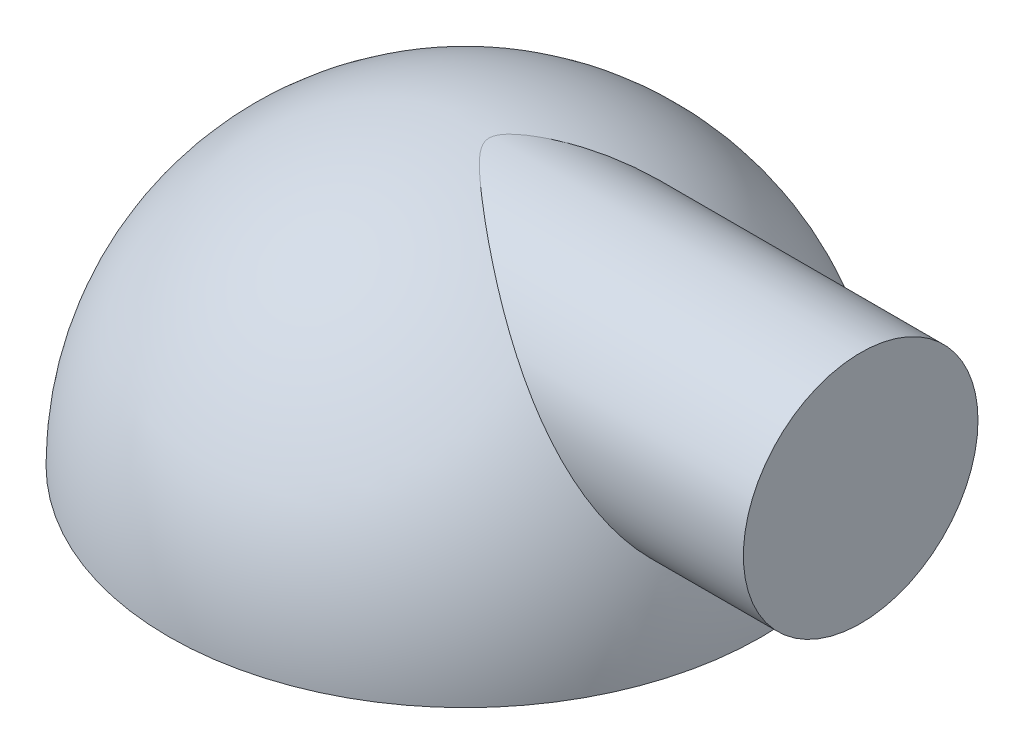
ISO-10303-21;
HEADER;
FILE_DESCRIPTION(('STEP AP214'),'2;1');
FILE_NAME('part.step','',(''),(''),'','','');
FILE_SCHEMA(('AUTOMOTIVE_DESIGN { 1 0 10303 214 1 1 1 1 }'));
ENDSEC;
DATA;
#1=APPLICATION_CONTEXT('core data for automotive mechanical design processes');
#2=APPLICATION_PROTOCOL_DEFINITION('international standard','automotive_design',2000,#1);
#3=PRODUCT_CONTEXT('',#1,'mechanical');
#4=PRODUCT('Part','Part','',(#3));
#5=PRODUCT_RELATED_PRODUCT_CATEGORY('part','',(#4));
#6=PRODUCT_DEFINITION_FORMATION('','',#4);
#7=PRODUCT_DEFINITION_CONTEXT('part definition',#1,'design');
#8=PRODUCT_DEFINITION('design','',#6,#7);
#9=PRODUCT_DEFINITION_SHAPE('','',#8);
#10=(LENGTH_UNIT() NAMED_UNIT(*) SI_UNIT(.MILLI.,.METRE.));
#11=(NAMED_UNIT(*) PLANE_ANGLE_UNIT() SI_UNIT($,.RADIAN.));
#12=(NAMED_UNIT(*) SI_UNIT($,.STERADIAN.) SOLID_ANGLE_UNIT());
#13=UNCERTAINTY_MEASURE_WITH_UNIT(LENGTH_MEASURE(1.E-05),#10,'distance_accuracy_value','');
#14=(GEOMETRIC_REPRESENTATION_CONTEXT(3) GLOBAL_UNCERTAINTY_ASSIGNED_CONTEXT((#13)) GLOBAL_UNIT_ASSIGNED_CONTEXT((#10,
#11,#12)) REPRESENTATION_CONTEXT('',''));
#15=CARTESIAN_POINT('',(0.,0.,0.));
#16=DIRECTION('',(0.,0.,1.));
#17=DIRECTION('',(1.,0.,0.));
#18=AXIS2_PLACEMENT_3D('',#15,#16,#17);
#19=CARTESIAN_POINT('',(0.,0.,0.));
#20=DIRECTION('',(0.,-1.,0.));
#21=DIRECTION('',(-1.,0.,0.));
#22=AXIS2_PLACEMENT_3D('',#19,#20,#21);
#23=SPHERICAL_SURFACE('',#22,30.);
#24=CARTESIAN_POINT('',(0.,0.,0.));
#25=DIRECTION('',(0.,-1.,0.));
#26=DIRECTION('',(1.,0.,0.));
#27=AXIS2_PLACEMENT_3D('',#24,#25,#26);
#28=CIRCLE('',#27,30.);
#29=CARTESIAN_POINT('',(30.,0.,0.));
#30=VERTEX_POINT('',#29);
#31=EDGE_CURVE('E39',#30,#30,#28,.T.);
#32=ORIENTED_EDGE('',*,*,#31,.F.);
#33=EDGE_LOOP('',(#32));
#34=FACE_BOUND('',#33,.T.);
#35=CARTESIAN_POINT('',(5.06357283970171,29.3528779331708,-3.5733439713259));
#36=CARTESIAN_POINT('',(4.82687446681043,29.4193358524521,-3.3628449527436));
#37=CARTESIAN_POINT('',(4.59214197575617,29.4805733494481,-3.14847148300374));
#38=CARTESIAN_POINT('',(4.12789198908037,29.5928167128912,-2.70777299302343));
#39=CARTESIAN_POINT('',(3.89842781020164,29.6437411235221,-2.48136939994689));
#40=CARTESIAN_POINT('',(3.56384481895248,29.711960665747,-2.12741076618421));
#41=CARTESIAN_POINT('',(3.4530889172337,29.733475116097,-2.00602128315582));
#42=CARTESIAN_POINT('',(3.23752401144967,29.773459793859,-1.75700892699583));
#43=CARTESIAN_POINT('',(3.13272863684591,29.791923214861,-1.62937291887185));
#44=CARTESIAN_POINT('',(2.93465736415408,29.8252340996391,-1.36752284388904));
#45=CARTESIAN_POINT('',(2.84125064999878,29.8401250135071,-1.23341448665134));
#46=CARTESIAN_POINT('',(2.6722454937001,29.8659536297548,-0.954172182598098));
#47=CARTESIAN_POINT('',(2.59655849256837,29.8769111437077,-0.8090980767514));
#48=CARTESIAN_POINT('',(2.5158285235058,29.8882705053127,-0.604307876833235));
#49=CARTESIAN_POINT('',(2.49680993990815,29.890908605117,-0.550273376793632));
#50=CARTESIAN_POINT('',(2.46351267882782,29.8954870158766,-0.44073530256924));
#51=CARTESIAN_POINT('',(2.44923433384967,29.8974272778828,-0.385231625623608));
#52=CARTESIAN_POINT('',(2.41489389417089,29.9020718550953,-0.217525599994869));
#53=CARTESIAN_POINT('',(2.40302373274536,29.9036413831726,-0.103410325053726));
#54=CARTESIAN_POINT('',(2.40453820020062,29.9034391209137,0.125094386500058));
#55=CARTESIAN_POINT('',(2.41803508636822,29.9016524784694,0.23948279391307));
#56=CARTESIAN_POINT('',(2.46698578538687,29.8950203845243,0.463714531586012));
#57=CARTESIAN_POINT('',(2.5025685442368,29.8901569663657,0.573527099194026));
#58=CARTESIAN_POINT('',(2.61086627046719,29.87486214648,0.840199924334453));
#59=CARTESIAN_POINT('',(2.69325720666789,29.8628599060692,0.992881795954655));
#60=CARTESIAN_POINT('',(2.83052211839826,29.8416718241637,1.21258498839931));
#61=CARTESIAN_POINT('',(2.87865706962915,29.8340615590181,1.28438835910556));
#62=CARTESIAN_POINT('',(2.97843446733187,29.8178580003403,1.42540347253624));
#63=CARTESIAN_POINT('',(3.03007559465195,29.8092650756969,1.49461617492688));
#64=CARTESIAN_POINT('',(3.19226653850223,29.781536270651,1.70341319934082));
#65=CARTESIAN_POINT('',(3.30702155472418,29.7609123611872,1.83950100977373));
#66=CARTESIAN_POINT('',(3.54299729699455,29.7161009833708,2.10538496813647));
#67=CARTESIAN_POINT('',(3.66422267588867,29.6919109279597,2.23517645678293));
#68=CARTESIAN_POINT('',(3.91102569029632,29.640078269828,2.49035739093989));
#69=CARTESIAN_POINT('',(4.03661194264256,29.6124285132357,2.6157370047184));
#70=CARTESIAN_POINT('',(4.29054435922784,29.5538049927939,2.86288332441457));
#71=CARTESIAN_POINT('',(4.41889090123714,29.5228307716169,2.98464953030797));
#72=CARTESIAN_POINT('',(4.80775728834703,29.424754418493,3.3465349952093));
#73=CARTESIAN_POINT('',(5.07112919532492,29.3527009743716,3.58226167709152));
#74=CARTESIAN_POINT('',(5.60135644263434,29.1958145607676,4.04462360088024));
#75=CARTESIAN_POINT('',(5.86820723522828,29.1109969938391,4.27126938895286));
#76=CARTESIAN_POINT('',(6.40395812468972,28.9287087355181,4.71686257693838));
#77=CARTESIAN_POINT('',(6.67285798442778,28.8312394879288,4.93581085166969));
#78=CARTESIAN_POINT('',(7.21170442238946,28.6238156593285,5.36640079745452));
#79=CARTESIAN_POINT('',(7.48165110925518,28.5138597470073,5.57804168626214));
#80=CARTESIAN_POINT('',(8.29242960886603,28.1653440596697,6.2022823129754));
#81=CARTESIAN_POINT('',(8.83388191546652,27.9082442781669,6.60393726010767));
#82=CARTESIAN_POINT('',(9.91397234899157,27.3468216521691,7.37446216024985));
#83=CARTESIAN_POINT('',(10.4526136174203,27.0425761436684,7.7433842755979));
#84=CARTESIAN_POINT('',(11.525825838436,26.3886064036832,8.44478828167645));
#85=CARTESIAN_POINT('',(12.0603977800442,26.0388936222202,8.77727930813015));
#86=CARTESIAN_POINT('',(13.1502459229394,25.2779269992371,9.41636353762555));
#87=CARTESIAN_POINT('',(13.7052313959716,24.8644789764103,9.72084962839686));
#88=CARTESIAN_POINT('',(14.8070043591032,23.9935293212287,10.2778362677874));
#89=CARTESIAN_POINT('',(15.3537900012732,23.5360179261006,10.5303252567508));
#90=CARTESIAN_POINT('',(16.4365617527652,22.581670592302,10.976239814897));
#91=CARTESIAN_POINT('',(16.9725536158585,22.0848563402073,11.1696976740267));
#92=CARTESIAN_POINT('',(18.0314232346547,21.0572237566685,11.490455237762));
#93=CARTESIAN_POINT('',(18.5543070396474,20.5264215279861,11.617786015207));
#94=CARTESIAN_POINT('',(19.4293422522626,19.6011863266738,11.7717126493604));
#95=CARTESIAN_POINT('',(19.7856026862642,19.213679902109,11.8170778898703));
#96=CARTESIAN_POINT('',(20.4891764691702,18.4280525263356,11.8692503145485));
#97=CARTESIAN_POINT('',(20.8364908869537,18.029932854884,11.8760621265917));
#98=CARTESIAN_POINT('',(21.5204362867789,17.2267396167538,11.8485615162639));
#99=CARTESIAN_POINT('',(21.8570789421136,16.8216744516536,11.8142957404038));
#100=CARTESIAN_POINT('',(22.5185218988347,16.0078900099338,11.7022037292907));
#101=CARTESIAN_POINT('',(22.8433241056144,15.5991713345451,11.6243845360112));
#102=CARTESIAN_POINT('',(23.4218235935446,14.8562121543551,11.4410606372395));
#103=CARTESIAN_POINT('',(23.677768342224,14.5218521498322,11.3430943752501));
#104=CARTESIAN_POINT('',(24.1793820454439,13.8562907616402,11.1151816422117));
#105=CARTESIAN_POINT('',(24.4250516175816,13.5250891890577,10.9852370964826));
#106=CARTESIAN_POINT('',(24.9046717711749,12.8691279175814,10.6924863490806));
#107=CARTESIAN_POINT('',(25.1386303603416,12.5443639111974,10.5297029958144));
#108=CARTESIAN_POINT('',(25.59357036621,11.9044676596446,10.1705009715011));
#109=CARTESIAN_POINT('',(25.8145537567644,11.5893339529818,9.97408743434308));
#110=CARTESIAN_POINT('',(26.2062035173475,11.0240811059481,9.58299479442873));
#111=CARTESIAN_POINT('',(26.3791042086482,10.7719029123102,9.39351906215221));
#112=CARTESIAN_POINT('',(26.7138043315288,10.2792240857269,8.99106999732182));
#113=CARTESIAN_POINT('',(26.8756057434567,10.0387213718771,8.77810087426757));
#114=CARTESIAN_POINT('',(27.1870681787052,9.57187512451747,8.32896765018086));
#115=CARTESIAN_POINT('',(27.3367290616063,9.34553175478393,8.09280328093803));
#116=CARTESIAN_POINT('',(27.6227913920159,8.90964429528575,7.59794746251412));
#117=CARTESIAN_POINT('',(27.7591926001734,8.70010050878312,7.33925560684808));
#118=CARTESIAN_POINT('',(28.0185241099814,8.29906828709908,6.79844525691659));
#119=CARTESIAN_POINT('',(28.141348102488,8.10772378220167,6.5161686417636));
#120=CARTESIAN_POINT('',(28.3711754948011,7.74762888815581,5.93142021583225));
#121=CARTESIAN_POINT('',(28.4781784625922,7.57887911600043,5.62894785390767));
#122=CARTESIAN_POINT('',(28.6751437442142,7.26677315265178,5.00610595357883));
#123=CARTESIAN_POINT('',(28.7651163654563,7.12340160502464,4.68574739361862));
#124=CARTESIAN_POINT('',(28.9270220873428,6.8644319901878,4.02962248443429));
#125=CARTESIAN_POINT('',(28.9989582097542,6.74882927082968,3.69385872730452));
#126=CARTESIAN_POINT('',(29.1157285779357,6.56065886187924,3.05469075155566));
#127=CARTESIAN_POINT('',(29.1628736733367,6.48444516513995,2.75277608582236));
#128=CARTESIAN_POINT('',(29.2423523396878,6.35574704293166,2.14202099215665));
#129=CARTESIAN_POINT('',(29.2746872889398,6.3032604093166,1.8331812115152));
#130=CARTESIAN_POINT('',(29.3241869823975,6.22284067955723,1.21127697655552));
#131=CARTESIAN_POINT('',(29.3413593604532,6.19489522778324,0.898214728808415));
#132=CARTESIAN_POINT('',(29.3603715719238,6.16395296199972,0.27039854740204));
#133=CARTESIAN_POINT('',(29.3622121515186,6.16095493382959,-0.0443553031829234));
#134=CARTESIAN_POINT('',(29.351041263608,6.17913855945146,-0.646063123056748));
#135=CARTESIAN_POINT('',(29.3392796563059,6.19828540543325,-0.93310468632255));
#136=CARTESIAN_POINT('',(29.3030203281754,6.25723788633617,-1.50422829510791));
#137=CARTESIAN_POINT('',(29.2785235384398,6.29704201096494,-1.78831055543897));
#138=CARTESIAN_POINT('',(29.2170205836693,6.39678656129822,-2.3515003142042));
#139=CARTESIAN_POINT('',(29.1800157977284,6.45672476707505,-2.63060835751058));
#140=CARTESIAN_POINT('',(29.0938217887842,6.59598314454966,-3.18202178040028));
#141=CARTESIAN_POINT('',(29.044632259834,6.67530380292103,-3.4543269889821));
#142=CARTESIAN_POINT('',(28.9343214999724,6.85262478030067,-3.99121327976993));
#143=CARTESIAN_POINT('',(28.873165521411,6.95067947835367,-4.25576922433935));
#144=CARTESIAN_POINT('',(28.7395060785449,7.16417479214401,-4.77478779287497));
#145=CARTESIAN_POINT('',(28.6670027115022,7.27961525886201,-5.02925050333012));
#146=CARTESIAN_POINT('',(28.5111826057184,7.52663100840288,-5.52679967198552));
#147=CARTESIAN_POINT('',(28.4278646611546,7.65820809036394,-5.76988485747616));
#148=CARTESIAN_POINT('',(28.2509936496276,7.93614654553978,-6.24357110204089));
#149=CARTESIAN_POINT('',(28.1574394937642,8.08250949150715,-6.47417082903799));
#150=CARTESIAN_POINT('',(27.9530120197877,8.40057256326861,-6.93946935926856));
#151=CARTESIAN_POINT('',(27.8413567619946,8.57335872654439,-7.17308223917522));
#152=CARTESIAN_POINT('',(27.6076032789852,8.93271264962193,-7.6238868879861));
#153=CARTESIAN_POINT('',(27.4855046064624,9.11928099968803,-7.84107795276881));
#154=CARTESIAN_POINT('',(27.2315768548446,9.50449684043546,-8.25848401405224));
#155=CARTESIAN_POINT('',(27.0997453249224,9.70314737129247,-8.4586947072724));
#156=CARTESIAN_POINT('',(26.8270900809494,10.1107997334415,-8.84170769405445));
#157=CARTESIAN_POINT('',(26.6862654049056,10.3198026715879,-9.02450812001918));
#158=CARTESIAN_POINT('',(26.3767953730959,10.7752530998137,-9.39591402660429));
#159=CARTESIAN_POINT('',(26.2069565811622,11.0229543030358,-9.58198954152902));
#160=CARTESIAN_POINT('',(25.8575373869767,11.527336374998,-9.93141247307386));
#161=CARTESIAN_POINT('',(25.6779562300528,11.7840179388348,-10.0947581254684));
#162=CARTESIAN_POINT('',(25.3098738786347,12.3043526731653,-10.3989380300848));
#163=CARTESIAN_POINT('',(25.1213699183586,12.5680079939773,-10.5397652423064));
#164=CARTESIAN_POINT('',(24.7362840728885,13.1003134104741,-10.7992041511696));
#165=CARTESIAN_POINT('',(24.5397012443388,13.3689640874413,-10.9178132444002));
#166=CARTESIAN_POINT('',(24.1045815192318,13.9562095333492,-11.151902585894));
#167=CARTESIAN_POINT('',(23.864664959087,14.2754126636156,-11.2633004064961));
#168=CARTESIAN_POINT('',(23.3758081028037,14.915689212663,-11.4571149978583));
#169=CARTESIAN_POINT('',(23.1268669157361,15.2367628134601,-11.5395288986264));
#170=CARTESIAN_POINT('',(22.6208202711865,15.8786096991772,-11.6764722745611));
#171=CARTESIAN_POINT('',(22.363711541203,16.199382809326,-11.7309904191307));
#172=CARTESIAN_POINT('',(21.8422570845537,16.8384832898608,-11.813260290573));
#173=CARTESIAN_POINT('',(21.5779104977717,17.1568103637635,-11.841008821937));
#174=CARTESIAN_POINT('',(20.9912779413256,17.8500062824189,-11.8738244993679));
#175=CARTESIAN_POINT('',(20.6676244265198,18.223978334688,-11.8735047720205));
#176=CARTESIAN_POINT('',(20.0122483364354,18.9631449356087,-11.8386401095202));
#177=CARTESIAN_POINT('',(19.6805248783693,19.3283385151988,-11.8040914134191));
#178=CARTESIAN_POINT('',(19.0099340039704,20.0476766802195,-11.7028824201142));
#179=CARTESIAN_POINT('',(18.6710648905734,20.4018185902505,-11.636214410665));
#180=CARTESIAN_POINT('',(17.987115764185,21.0969500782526,-11.4728744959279));
#181=CARTESIAN_POINT('',(17.6420351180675,21.4379383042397,-11.3761995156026));
#182=CARTESIAN_POINT('',(16.8800127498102,22.1686874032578,-11.1337825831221));
#183=CARTESIAN_POINT('',(16.4619308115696,22.5553292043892,-10.9821963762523));
#184=CARTESIAN_POINT('',(15.6192277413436,23.3048738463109,-10.6428132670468));
#185=CARTESIAN_POINT('',(15.1946058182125,23.6677737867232,-10.4550119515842));
#186=CARTESIAN_POINT('',(14.3394535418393,24.3680081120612,-10.0462805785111));
#187=CARTESIAN_POINT('',(13.9089175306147,24.7053156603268,-9.82531644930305));
#188=CARTESIAN_POINT('',(13.0433726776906,25.3520972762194,-9.35356419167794));
#189=CARTESIAN_POINT('',(12.6083638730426,25.6615715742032,-9.10277631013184));
#190=CARTESIAN_POINT('',(11.6616037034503,26.3005454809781,-8.53005602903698));
#191=CARTESIAN_POINT('',(11.1491999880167,26.6247199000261,-8.20324258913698));
#192=CARTESIAN_POINT('',(10.1210522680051,27.2310450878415,-7.51722008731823));
#193=CARTESIAN_POINT('',(9.60530731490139,27.5131833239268,-7.15800141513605));
#194=CARTESIAN_POINT('',(8.57303359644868,28.0334100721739,-6.41122423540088));
#195=CARTESIAN_POINT('',(8.05650632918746,28.2715469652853,-6.02369751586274));
#196=CARTESIAN_POINT('',(7.28334299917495,28.594855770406,-5.42267054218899));
#197=CARTESIAN_POINT('',(7.02594100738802,28.6969600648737,-5.21907854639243));
#198=CARTESIAN_POINT('',(6.51225781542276,28.8897643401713,-4.80520920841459));
#199=CARTESIAN_POINT('',(6.2559764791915,28.9804657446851,-4.59493270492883));
#200=CARTESIAN_POINT('',(5.84332156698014,29.1177751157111,-4.24920128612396));
#201=CARTESIAN_POINT('',(5.68628631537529,29.1679635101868,-4.11594331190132));
#202=CARTESIAN_POINT('',(5.37374697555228,29.2637968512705,-3.84678517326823));
#203=CARTESIAN_POINT('',(5.21824021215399,29.3094518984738,-3.7108917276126));
#204=CARTESIAN_POINT('',(5.06357283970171,29.3528779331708,-3.5733439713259));
#205=B_SPLINE_CURVE_WITH_KNOTS('',3,(#35,#36,#37,#38,#39,#40,#41,#42,#43,#44,#45,#46,#47,#48,
#49,#50,#51,#52,#53,#54,#55,#56,#57,#58,#59,#60,#61,#62,#63,#64,#65,#66,#67,#68,#69,#70,#71,#72,
#73,#74,#75,#76,#77,#78,#79,#80,#81,#82,#83,#84,#85,#86,#87,#88,#89,#90,#91,#92,#93,#94,#95,#96,
#97,#98,#99,#100,#101,#102,#103,#104,#105,#106,#107,#108,#109,#110,#111,#112,#113,#114,#115,
#116,#117,#118,#119,#120,#121,#122,#123,#124,#125,#126,#127,#128,#129,#130,#131,#132,#133,#134,
#135,#136,#137,#138,#139,#140,#141,#142,#143,#144,#145,#146,#147,#148,#149,#150,#151,#152,#153,
#154,#155,#156,#157,#158,#159,#160,#161,#162,#163,#164,#165,#166,#167,#168,#169,#170,#171,#172,
#173,#174,#175,#176,#177,#178,#179,#180,#181,#182,#183,#184,#185,#186,#187,#188,#189,#190,#191,
#192,#193,#194,#195,#196,#197,#198,#199,#200,#201,#202,#203,#204),.UNSPECIFIED.,.T.,.F.,(4,2,2,
2,2,2,2,2,2,2,2,2,2,2,2,2,2,2,2,2,2,2,2,2,2,2,2,2,2,2,2,2,2,2,2,2,2,2,2,2,2,2,2,2,2,2,2,2,2,2,2,
2,2,2,2,2,2,2,2,2,2,2,2,2,2,2,2,2,2,2,2,2,2,2,2,2,2,2,2,2,2,2,2,2,4),(0.,0.970925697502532,
1.94924420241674,2.44627037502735,2.9443907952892,3.43610501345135,3.92530663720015,
4.09714197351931,4.26898936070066,4.61038085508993,4.953286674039,5.29821359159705,
5.81696347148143,6.07728854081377,6.33751620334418,6.87468188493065,7.41223918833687,
7.95092699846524,8.48968900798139,9.57139678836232,10.6518095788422,11.7320991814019,
12.8125040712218,14.9745892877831,17.1331647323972,19.2911976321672,21.5564374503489,
23.8221803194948,26.0866815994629,28.3501178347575,29.9337146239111,31.5171213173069,
33.0987316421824,34.6800863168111,35.9758409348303,37.2715175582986,38.5662957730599,
39.8608765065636,40.938953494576,42.0168376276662,43.0947342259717,44.1726502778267,
45.2584840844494,46.3443475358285,47.4295516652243,48.5145738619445,49.4581119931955,
50.4015622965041,51.3445373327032,52.2874664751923,53.1501990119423,54.0128684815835,
54.8754428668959,55.7380389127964,56.6031779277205,57.468309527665,58.3335376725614,
59.1988579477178,60.131745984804,61.0646739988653,61.9978377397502,62.9311014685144,
63.9899717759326,65.0489242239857,66.1082070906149,67.167614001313,68.4100891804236,
69.6526873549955,70.8957898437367,72.139040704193,73.6213359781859,75.1037941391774,
76.5866084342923,78.0695747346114,79.835697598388,81.6020358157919,83.3702013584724,
85.1383522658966,87.2025995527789,89.2674610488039,91.3300384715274,92.3609427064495,
93.3917181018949,94.0276066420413,94.6620449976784),.UNSPECIFIED.);
#206=CARTESIAN_POINT('',(5.06357283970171,29.3528779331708,-3.5733439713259));
#207=VERTEX_POINT('',#206);
#208=EDGE_CURVE('E10',#207,#207,#205,.T.);
#209=ORIENTED_EDGE('',*,*,#208,.F.);
#210=EDGE_LOOP('',(#209));
#211=FACE_BOUND('',#210,.T.);
#212=ADVANCED_FACE('F29',(#34,#211),#23,.T.);
#213=CARTESIAN_POINT('',(-30.,0.,0.));
#214=DIRECTION('',(0.,1.,0.));
#215=DIRECTION('',(-1.,0.,0.));
#216=AXIS2_PLACEMENT_3D('',#213,#214,#215);
#217=PLANE('',#216);
#218=ORIENTED_EDGE('',*,*,#31,.T.);
#219=EDGE_LOOP('',(#218));
#220=FACE_BOUND('',#219,.T.);
#221=ADVANCED_FACE('F54',(#220),#217,.F.);
#222=CARTESIAN_POINT('',(40.,18.0342891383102,0.));
#223=DIRECTION('',(-1.,0.,0.));
#224=DIRECTION('',(0.,0.,1.));
#225=AXIS2_PLACEMENT_3D('',#222,#223,#224);
#226=CYLINDRICAL_SURFACE('',#225,11.8692560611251);
#227=CARTESIAN_POINT('',(40.,18.0342891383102,0.));
#228=DIRECTION('',(1.,0.,0.));
#229=DIRECTION('',(0.,0.,-1.));
#230=AXIS2_PLACEMENT_3D('',#227,#228,#229);
#231=CIRCLE('',#230,11.8692560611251);
#232=CARTESIAN_POINT('',(40.,18.0342891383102,-11.8692560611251));
#233=VERTEX_POINT('',#232);
#234=EDGE_CURVE('E43',#233,#233,#231,.T.);
#235=ORIENTED_EDGE('',*,*,#234,.F.);
#236=EDGE_LOOP('',(#235));
#237=FACE_BOUND('',#236,.T.);
#238=ORIENTED_EDGE('',*,*,#208,.T.);
#239=EDGE_LOOP('',(#238));
#240=FACE_BOUND('',#239,.T.);
#241=ADVANCED_FACE('F52',(#237,#240),#226,.T.);
#242=CARTESIAN_POINT('',(40.,18.0342891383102,0.));
#243=DIRECTION('',(1.,0.,0.));
#244=DIRECTION('',(0.,0.,-1.));
#245=AXIS2_PLACEMENT_3D('',#242,#243,#244);
#246=PLANE('',#245);
#247=ORIENTED_EDGE('',*,*,#234,.T.);
#248=EDGE_LOOP('',(#247));
#249=FACE_BOUND('',#248,.T.);
#250=ADVANCED_FACE('F50',(#249),#246,.T.);
#251=CLOSED_SHELL('',(#212,#221,#241,#250));
#252=MANIFOLD_SOLID_BREP('B2',#251);
#253=ADVANCED_BREP_SHAPE_REPRESENTATION('',(#18,#252),#14);
#254=SHAPE_DEFINITION_REPRESENTATION(#9,#253);
ENDSEC;
END-ISO-10303-21;
